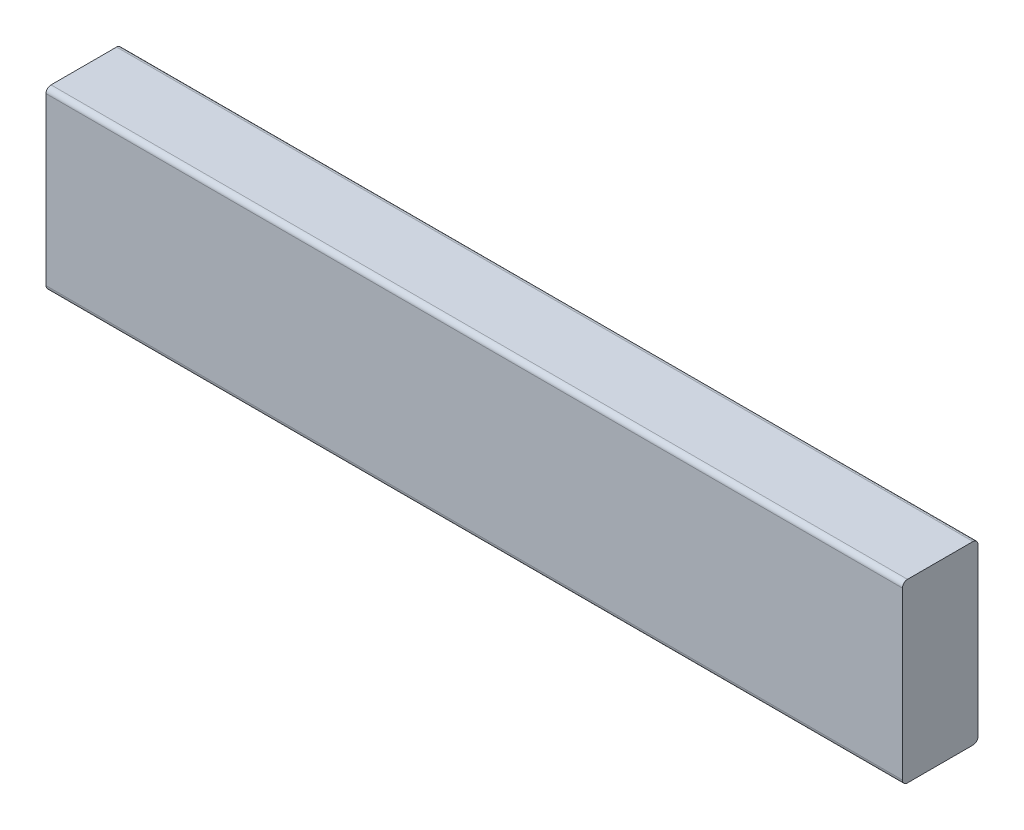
ISO-10303-21;
HEADER;
FILE_DESCRIPTION(('STEP AP214'),'2;1');
FILE_NAME('part.step','',(''),(''),'','','');
FILE_SCHEMA(('AUTOMOTIVE_DESIGN { 1 0 10303 214 1 1 1 1 }'));
ENDSEC;
DATA;
#1=APPLICATION_CONTEXT('core data for automotive mechanical design processes');
#2=APPLICATION_PROTOCOL_DEFINITION('international standard','automotive_design',2000,#1);
#3=PRODUCT_CONTEXT('',#1,'mechanical');
#4=PRODUCT('Part','Part','',(#3));
#5=PRODUCT_RELATED_PRODUCT_CATEGORY('part','',(#4));
#6=PRODUCT_DEFINITION_FORMATION('','',#4);
#7=PRODUCT_DEFINITION_CONTEXT('part definition',#1,'design');
#8=PRODUCT_DEFINITION('design','',#6,#7);
#9=PRODUCT_DEFINITION_SHAPE('','',#8);
#10=(LENGTH_UNIT() NAMED_UNIT(*) SI_UNIT(.MILLI.,.METRE.));
#11=(NAMED_UNIT(*) PLANE_ANGLE_UNIT() SI_UNIT($,.RADIAN.));
#12=(NAMED_UNIT(*) SI_UNIT($,.STERADIAN.) SOLID_ANGLE_UNIT());
#13=UNCERTAINTY_MEASURE_WITH_UNIT(LENGTH_MEASURE(1.E-05),#10,'distance_accuracy_value','');
#14=(GEOMETRIC_REPRESENTATION_CONTEXT(3) GLOBAL_UNCERTAINTY_ASSIGNED_CONTEXT((#13)) GLOBAL_UNIT_ASSIGNED_CONTEXT((#10,
#11,#12)) REPRESENTATION_CONTEXT('',''));
#15=CARTESIAN_POINT('',(0.,0.,0.));
#16=DIRECTION('',(0.,0.,1.));
#17=DIRECTION('',(1.,0.,0.));
#18=AXIS2_PLACEMENT_3D('',#15,#16,#17);
#19=CARTESIAN_POINT('',(215.9,-44.45,-19.05));
#20=DIRECTION('',(0.,0.,1.));
#21=DIRECTION('',(1.,0.,0.));
#22=AXIS2_PLACEMENT_3D('',#19,#20,#21);
#23=PLANE('',#22);
#24=DIRECTION('',(0.,1.,0.));
#25=VECTOR('',#24,1.);
#26=CARTESIAN_POINT('',(215.9,-44.45,-19.05));
#27=LINE('',#26,#25);
#28=CARTESIAN_POINT('',(215.9,-41.91,-19.05));
#29=VERTEX_POINT('',#28);
#30=CARTESIAN_POINT('',(215.9,41.91,-19.05));
#31=VERTEX_POINT('',#30);
#32=EDGE_CURVE('E122',#29,#31,#27,.T.);
#33=ORIENTED_EDGE('',*,*,#32,.F.);
#34=DIRECTION('',(-1.,0.,0.));
#35=VECTOR('',#34,1.);
#36=CARTESIAN_POINT('',(215.9,-41.91,-19.05));
#37=LINE('',#36,#35);
#38=CARTESIAN_POINT('',(-215.9,-41.91,-19.05));
#39=VERTEX_POINT('',#38);
#40=EDGE_CURVE('E148',#29,#39,#37,.T.);
#41=ORIENTED_EDGE('',*,*,#40,.T.);
#42=DIRECTION('',(0.,1.,0.));
#43=VECTOR('',#42,1.);
#44=CARTESIAN_POINT('',(-215.9,-44.45,-19.05));
#45=LINE('',#44,#43);
#46=CARTESIAN_POINT('',(-215.9,41.91,-19.05));
#47=VERTEX_POINT('',#46);
#48=EDGE_CURVE('E154',#39,#47,#45,.T.);
#49=ORIENTED_EDGE('',*,*,#48,.T.);
#50=DIRECTION('',(-1.,0.,0.));
#51=VECTOR('',#50,1.);
#52=CARTESIAN_POINT('',(215.9,41.91,-19.05));
#53=LINE('',#52,#51);
#54=EDGE_CURVE('E146',#47,#31,#53,.F.);
#55=ORIENTED_EDGE('',*,*,#54,.T.);
#56=EDGE_LOOP('',(#33,#41,#49,#55));
#57=FACE_BOUND('',#56,.T.);
#58=ADVANCED_FACE('F30',(#57),#23,.F.);
#59=CARTESIAN_POINT('',(215.9,44.45,19.05));
#60=DIRECTION('',(0.,-1.,0.));
#61=DIRECTION('',(0.,0.,-1.));
#62=AXIS2_PLACEMENT_3D('',#59,#60,#61);
#63=PLANE('',#62);
#64=DIRECTION('',(0.,0.,1.));
#65=VECTOR('',#64,1.);
#66=CARTESIAN_POINT('',(215.9,44.45,19.05));
#67=LINE('',#66,#65);
#68=CARTESIAN_POINT('',(215.9,44.45,-16.51));
#69=VERTEX_POINT('',#68);
#70=CARTESIAN_POINT('',(215.9,44.45,16.51));
#71=VERTEX_POINT('',#70);
#72=EDGE_CURVE('E125',#69,#71,#67,.T.);
#73=ORIENTED_EDGE('',*,*,#72,.F.);
#74=DIRECTION('',(-1.,0.,0.));
#75=VECTOR('',#74,1.);
#76=CARTESIAN_POINT('',(215.9,44.45,-16.51));
#77=LINE('',#76,#75);
#78=CARTESIAN_POINT('',(-215.9,44.45,-16.51));
#79=VERTEX_POINT('',#78);
#80=EDGE_CURVE('E11',#69,#79,#77,.T.);
#81=ORIENTED_EDGE('',*,*,#80,.T.);
#82=DIRECTION('',(0.,0.,1.));
#83=VECTOR('',#82,1.);
#84=CARTESIAN_POINT('',(-215.9,44.45,19.05));
#85=LINE('',#84,#83);
#86=CARTESIAN_POINT('',(-215.9,44.45,16.51));
#87=VERTEX_POINT('',#86);
#88=EDGE_CURVE('E127',#79,#87,#85,.T.);
#89=ORIENTED_EDGE('',*,*,#88,.T.);
#90=DIRECTION('',(-1.,0.,0.));
#91=VECTOR('',#90,1.);
#92=CARTESIAN_POINT('',(215.9,44.45,16.51));
#93=LINE('',#92,#91);
#94=EDGE_CURVE('E38',#87,#71,#93,.F.);
#95=ORIENTED_EDGE('',*,*,#94,.T.);
#96=EDGE_LOOP('',(#73,#81,#89,#95));
#97=FACE_BOUND('',#96,.T.);
#98=ADVANCED_FACE('F173',(#97),#63,.F.);
#99=CARTESIAN_POINT('',(215.9,-44.45,19.05));
#100=DIRECTION('',(0.,0.,-1.));
#101=DIRECTION('',(-1.,0.,0.));
#102=AXIS2_PLACEMENT_3D('',#99,#100,#101);
#103=PLANE('',#102);
#104=DIRECTION('',(0.,-1.,0.));
#105=VECTOR('',#104,1.);
#106=CARTESIAN_POINT('',(-215.9,-44.45,19.05));
#107=LINE('',#106,#105);
#108=CARTESIAN_POINT('',(-215.9,41.91,19.05));
#109=VERTEX_POINT('',#108);
#110=CARTESIAN_POINT('',(-215.9,-41.91,19.05));
#111=VERTEX_POINT('',#110);
#112=EDGE_CURVE('E123',#109,#111,#107,.T.);
#113=ORIENTED_EDGE('',*,*,#112,.T.);
#114=DIRECTION('',(-1.,0.,0.));
#115=VECTOR('',#114,1.);
#116=CARTESIAN_POINT('',(215.9,-41.91,19.05));
#117=LINE('',#116,#115);
#118=CARTESIAN_POINT('',(215.9,-41.91,19.05));
#119=VERTEX_POINT('',#118);
#120=EDGE_CURVE('E101',#111,#119,#117,.F.);
#121=ORIENTED_EDGE('',*,*,#120,.T.);
#122=DIRECTION('',(0.,-1.,0.));
#123=VECTOR('',#122,1.);
#124=CARTESIAN_POINT('',(215.9,-44.45,19.05));
#125=LINE('',#124,#123);
#126=CARTESIAN_POINT('',(215.9,41.91,19.05));
#127=VERTEX_POINT('',#126);
#128=EDGE_CURVE('E162',#127,#119,#125,.T.);
#129=ORIENTED_EDGE('',*,*,#128,.F.);
#130=DIRECTION('',(-1.,0.,0.));
#131=VECTOR('',#130,1.);
#132=CARTESIAN_POINT('',(215.9,41.91,19.05));
#133=LINE('',#132,#131);
#134=EDGE_CURVE('E106',#127,#109,#133,.T.);
#135=ORIENTED_EDGE('',*,*,#134,.T.);
#136=EDGE_LOOP('',(#113,#121,#129,#135));
#137=FACE_BOUND('',#136,.T.);
#138=ADVANCED_FACE('F172',(#137),#103,.F.);
#139=CARTESIAN_POINT('',(215.9,-44.45,19.05));
#140=DIRECTION('',(0.,1.,0.));
#141=DIRECTION('',(0.,0.,1.));
#142=AXIS2_PLACEMENT_3D('',#139,#140,#141);
#143=PLANE('',#142);
#144=DIRECTION('',(0.,0.,-1.));
#145=VECTOR('',#144,1.);
#146=CARTESIAN_POINT('',(215.9,-44.45,19.05));
#147=LINE('',#146,#145);
#148=CARTESIAN_POINT('',(215.9,-44.45,16.51));
#149=VERTEX_POINT('',#148);
#150=CARTESIAN_POINT('',(215.9,-44.45,-16.51));
#151=VERTEX_POINT('',#150);
#152=EDGE_CURVE('E116',#149,#151,#147,.T.);
#153=ORIENTED_EDGE('',*,*,#152,.F.);
#154=DIRECTION('',(-1.,0.,0.));
#155=VECTOR('',#154,1.);
#156=CARTESIAN_POINT('',(215.9,-44.45,16.51));
#157=LINE('',#156,#155);
#158=CARTESIAN_POINT('',(-215.9,-44.45,16.51));
#159=VERTEX_POINT('',#158);
#160=EDGE_CURVE('E100',#149,#159,#157,.T.);
#161=ORIENTED_EDGE('',*,*,#160,.T.);
#162=DIRECTION('',(0.,0.,-1.));
#163=VECTOR('',#162,1.);
#164=CARTESIAN_POINT('',(-215.9,-44.45,19.05));
#165=LINE('',#164,#163);
#166=CARTESIAN_POINT('',(-215.9,-44.45,-16.51));
#167=VERTEX_POINT('',#166);
#168=EDGE_CURVE('E113',#159,#167,#165,.T.);
#169=ORIENTED_EDGE('',*,*,#168,.T.);
#170=DIRECTION('',(-1.,0.,0.));
#171=VECTOR('',#170,1.);
#172=CARTESIAN_POINT('',(215.9,-44.45,-16.51));
#173=LINE('',#172,#171);
#174=EDGE_CURVE('E118',#167,#151,#173,.F.);
#175=ORIENTED_EDGE('',*,*,#174,.T.);
#176=EDGE_LOOP('',(#153,#161,#169,#175));
#177=FACE_BOUND('',#176,.T.);
#178=ADVANCED_FACE('F112',(#177),#143,.F.);
#179=CARTESIAN_POINT('',(215.9,44.45,-19.05));
#180=DIRECTION('',(-1.,0.,0.));
#181=DIRECTION('',(0.,0.,1.));
#182=AXIS2_PLACEMENT_3D('',#179,#180,#181);
#183=PLANE('',#182);
#184=ORIENTED_EDGE('',*,*,#128,.T.);
#185=CARTESIAN_POINT('',(215.9,-41.91,16.51));
#186=DIRECTION('',(-1.,0.,0.));
#187=DIRECTION('',(0.,0.,1.));
#188=AXIS2_PLACEMENT_3D('',#185,#186,#187);
#189=CIRCLE('',#188,2.54);
#190=EDGE_CURVE('E144',#119,#149,#189,.F.);
#191=ORIENTED_EDGE('',*,*,#190,.T.);
#192=ORIENTED_EDGE('',*,*,#152,.T.);
#193=CARTESIAN_POINT('',(215.9,-41.91,-16.51));
#194=DIRECTION('',(-1.,0.,0.));
#195=DIRECTION('',(0.,0.,1.));
#196=AXIS2_PLACEMENT_3D('',#193,#194,#195);
#197=CIRCLE('',#196,2.54);
#198=EDGE_CURVE('E142',#151,#29,#197,.F.);
#199=ORIENTED_EDGE('',*,*,#198,.T.);
#200=ORIENTED_EDGE('',*,*,#32,.T.);
#201=CARTESIAN_POINT('',(215.9,41.91,-16.51));
#202=DIRECTION('',(-1.,0.,0.));
#203=DIRECTION('',(0.,0.,1.));
#204=AXIS2_PLACEMENT_3D('',#201,#202,#203);
#205=CIRCLE('',#204,2.54);
#206=EDGE_CURVE('E51',#31,#69,#205,.F.);
#207=ORIENTED_EDGE('',*,*,#206,.T.);
#208=ORIENTED_EDGE('',*,*,#72,.T.);
#209=CARTESIAN_POINT('',(215.9,41.91,16.51));
#210=DIRECTION('',(-1.,0.,0.));
#211=DIRECTION('',(0.,0.,1.));
#212=AXIS2_PLACEMENT_3D('',#209,#210,#211);
#213=CIRCLE('',#212,2.54);
#214=EDGE_CURVE('E139',#71,#127,#213,.F.);
#215=ORIENTED_EDGE('',*,*,#214,.T.);
#216=EDGE_LOOP('',(#184,#191,#192,#199,#200,#207,#208,#215));
#217=FACE_BOUND('',#216,.T.);
#218=ADVANCED_FACE('F166',(#217),#183,.F.);
#219=CARTESIAN_POINT('',(-215.9,44.45,-19.05));
#220=DIRECTION('',(-1.,0.,0.));
#221=DIRECTION('',(0.,0.,1.));
#222=AXIS2_PLACEMENT_3D('',#219,#220,#221);
#223=PLANE('',#222);
#224=ORIENTED_EDGE('',*,*,#168,.F.);
#225=CARTESIAN_POINT('',(-215.9,-41.91,16.51));
#226=DIRECTION('',(-1.,0.,0.));
#227=DIRECTION('',(0.,0.,1.));
#228=AXIS2_PLACEMENT_3D('',#225,#226,#227);
#229=CIRCLE('',#228,2.54);
#230=EDGE_CURVE('E96',#159,#111,#229,.T.);
#231=ORIENTED_EDGE('',*,*,#230,.T.);
#232=ORIENTED_EDGE('',*,*,#112,.F.);
#233=CARTESIAN_POINT('',(-215.9,41.91,16.51));
#234=DIRECTION('',(-1.,0.,0.));
#235=DIRECTION('',(0.,0.,1.));
#236=AXIS2_PLACEMENT_3D('',#233,#234,#235);
#237=CIRCLE('',#236,2.54);
#238=EDGE_CURVE('E117',#109,#87,#237,.T.);
#239=ORIENTED_EDGE('',*,*,#238,.T.);
#240=ORIENTED_EDGE('',*,*,#88,.F.);
#241=CARTESIAN_POINT('',(-215.9,41.91,-16.51));
#242=DIRECTION('',(-1.,0.,0.));
#243=DIRECTION('',(0.,0.,1.));
#244=AXIS2_PLACEMENT_3D('',#241,#242,#243);
#245=CIRCLE('',#244,2.54);
#246=EDGE_CURVE('E133',#79,#47,#245,.T.);
#247=ORIENTED_EDGE('',*,*,#246,.T.);
#248=ORIENTED_EDGE('',*,*,#48,.F.);
#249=CARTESIAN_POINT('',(-215.9,-41.91,-16.51));
#250=DIRECTION('',(-1.,0.,0.));
#251=DIRECTION('',(0.,0.,1.));
#252=AXIS2_PLACEMENT_3D('',#249,#250,#251);
#253=CIRCLE('',#252,2.54);
#254=EDGE_CURVE('E107',#39,#167,#253,.T.);
#255=ORIENTED_EDGE('',*,*,#254,.T.);
#256=EDGE_LOOP('',(#224,#231,#232,#239,#240,#247,#248,#255));
#257=FACE_BOUND('',#256,.T.);
#258=ADVANCED_FACE('F120',(#257),#223,.T.);
#259=CARTESIAN_POINT('',(215.9,-41.91,16.51));
#260=DIRECTION('',(-1.,0.,0.));
#261=DIRECTION('',(0.,0.,1.));
#262=AXIS2_PLACEMENT_3D('',#259,#260,#261);
#263=CYLINDRICAL_SURFACE('',#262,2.54);
#264=ORIENTED_EDGE('',*,*,#190,.F.);
#265=ORIENTED_EDGE('',*,*,#120,.F.);
#266=ORIENTED_EDGE('',*,*,#230,.F.);
#267=ORIENTED_EDGE('',*,*,#160,.F.);
#268=EDGE_LOOP('',(#264,#265,#266,#267));
#269=FACE_BOUND('',#268,.T.);
#270=ADVANCED_FACE('F99',(#269),#263,.T.);
#271=CARTESIAN_POINT('',(215.9,-41.91,-16.51));
#272=DIRECTION('',(-1.,0.,0.));
#273=DIRECTION('',(0.,0.,1.));
#274=AXIS2_PLACEMENT_3D('',#271,#272,#273);
#275=CYLINDRICAL_SURFACE('',#274,2.54);
#276=ORIENTED_EDGE('',*,*,#198,.F.);
#277=ORIENTED_EDGE('',*,*,#174,.F.);
#278=ORIENTED_EDGE('',*,*,#254,.F.);
#279=ORIENTED_EDGE('',*,*,#40,.F.);
#280=EDGE_LOOP('',(#276,#277,#278,#279));
#281=FACE_BOUND('',#280,.T.);
#282=ADVANCED_FACE('F176',(#281),#275,.T.);
#283=CARTESIAN_POINT('',(215.9,41.91,-16.51));
#284=DIRECTION('',(-1.,0.,0.));
#285=DIRECTION('',(0.,0.,1.));
#286=AXIS2_PLACEMENT_3D('',#283,#284,#285);
#287=CYLINDRICAL_SURFACE('',#286,2.54);
#288=ORIENTED_EDGE('',*,*,#206,.F.);
#289=ORIENTED_EDGE('',*,*,#54,.F.);
#290=ORIENTED_EDGE('',*,*,#246,.F.);
#291=ORIENTED_EDGE('',*,*,#80,.F.);
#292=EDGE_LOOP('',(#288,#289,#290,#291));
#293=FACE_BOUND('',#292,.T.);
#294=ADVANCED_FACE('F175',(#293),#287,.T.);
#295=CARTESIAN_POINT('',(215.9,41.91,16.51));
#296=DIRECTION('',(-1.,0.,0.));
#297=DIRECTION('',(0.,0.,1.));
#298=AXIS2_PLACEMENT_3D('',#295,#296,#297);
#299=CYLINDRICAL_SURFACE('',#298,2.54);
#300=ORIENTED_EDGE('',*,*,#214,.F.);
#301=ORIENTED_EDGE('',*,*,#94,.F.);
#302=ORIENTED_EDGE('',*,*,#238,.F.);
#303=ORIENTED_EDGE('',*,*,#134,.F.);
#304=EDGE_LOOP('',(#300,#301,#302,#303));
#305=FACE_BOUND('',#304,.T.);
#306=ADVANCED_FACE('F32',(#305),#299,.T.);
#307=CLOSED_SHELL('',(#58,#98,#138,#178,#218,#258,#270,#282,#294,#306));
#308=MANIFOLD_SOLID_BREP('B2',#307);
#309=ADVANCED_BREP_SHAPE_REPRESENTATION('',(#18,#308),#14);
#310=SHAPE_DEFINITION_REPRESENTATION(#9,#309);
ENDSEC;
END-ISO-10303-21;
